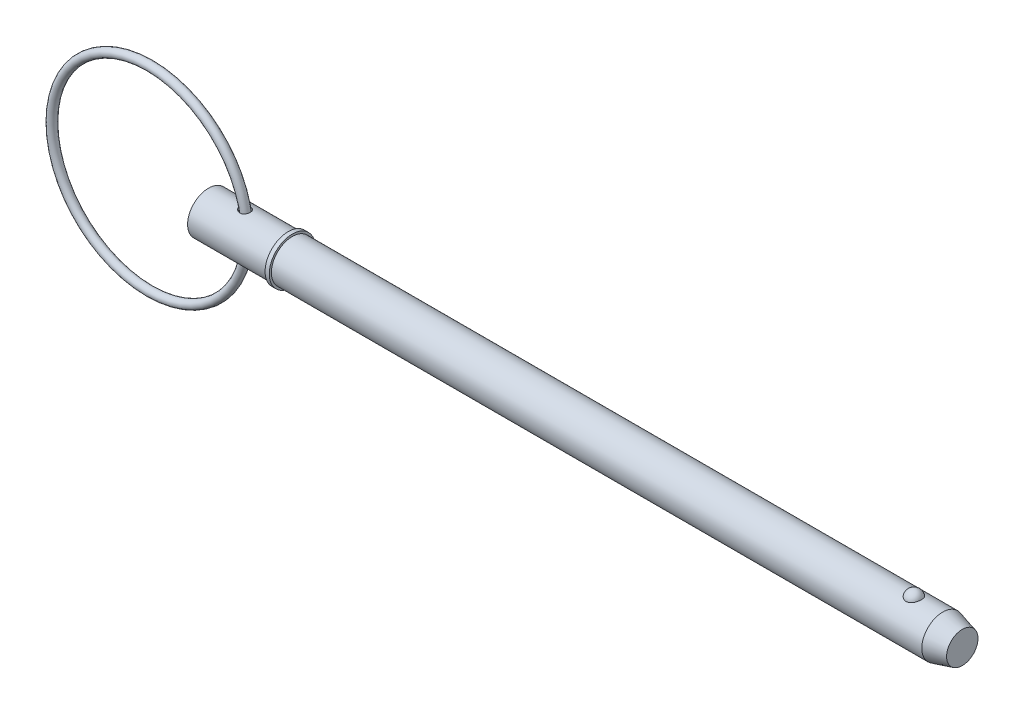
ISO-10303-21;
HEADER;
FILE_DESCRIPTION(('STEP AP214'),'2;1');
FILE_NAME('part.step','',(''),(''),'','','');
FILE_SCHEMA(('AUTOMOTIVE_DESIGN { 1 0 10303 214 1 1 1 1 }'));
ENDSEC;
DATA;
#1=APPLICATION_CONTEXT('core data for automotive mechanical design processes');
#2=APPLICATION_PROTOCOL_DEFINITION('international standard','automotive_design',2000,#1);
#3=PRODUCT_CONTEXT('',#1,'mechanical');
#4=PRODUCT('Part','Part','',(#3));
#5=PRODUCT_RELATED_PRODUCT_CATEGORY('part','',(#4));
#6=PRODUCT_DEFINITION_FORMATION('','',#4);
#7=PRODUCT_DEFINITION_CONTEXT('part definition',#1,'design');
#8=PRODUCT_DEFINITION('design','',#6,#7);
#9=PRODUCT_DEFINITION_SHAPE('','',#8);
#10=(LENGTH_UNIT() NAMED_UNIT(*) SI_UNIT(.MILLI.,.METRE.));
#11=(NAMED_UNIT(*) PLANE_ANGLE_UNIT() SI_UNIT($,.RADIAN.));
#12=(NAMED_UNIT(*) SI_UNIT($,.STERADIAN.) SOLID_ANGLE_UNIT());
#13=UNCERTAINTY_MEASURE_WITH_UNIT(LENGTH_MEASURE(1.E-05),#10,'distance_accuracy_value','');
#14=(GEOMETRIC_REPRESENTATION_CONTEXT(3) GLOBAL_UNCERTAINTY_ASSIGNED_CONTEXT((#13)) GLOBAL_UNIT_ASSIGNED_CONTEXT((#10,
#11,#12)) REPRESENTATION_CONTEXT('',''));
#15=CARTESIAN_POINT('',(0.,0.,0.));
#16=DIRECTION('',(0.,0.,1.));
#17=DIRECTION('',(1.,0.,0.));
#18=AXIS2_PLACEMENT_3D('',#15,#16,#17);
#19=CARTESIAN_POINT('',(-13.4013067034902,0.,0.));
#20=DIRECTION('',(0.,0.,1.));
#21=DIRECTION('',(1.,0.,0.));
#22=AXIS2_PLACEMENT_3D('',#19,#20,#21);
#23=TOROIDAL_SURFACE('',#22,22.225,0.952999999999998);
#24=CARTESIAN_POINT('',(9.77669329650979,0.,0.));
#25=VERTEX_POINT('',#24);
#26=VERTEX_LOOP('',#25);
#27=FACE_BOUND('',#26,.T.);
#28=ADVANCED_FACE('P0_F12',(#27),#23,.T.);
#29=CLOSED_SHELL('',(#28));
#30=MANIFOLD_SOLID_BREP('P0_B1',#29);
#31=CARTESIAN_POINT('',(0.,0.,0.));
#32=DIRECTION('',(1.,0.,0.));
#33=DIRECTION('',(0.,0.,-1.));
#34=AXIS2_PLACEMENT_3D('',#31,#32,#33);
#35=CYLINDRICAL_SURFACE('',#34,4.765);
#36=CARTESIAN_POINT('',(7.48459594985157,4.685973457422,-0.864220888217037));
#37=CARTESIAN_POINT('',(7.53849733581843,4.67711144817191,-0.912273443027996));
#38=CARTESIAN_POINT('',(7.59654891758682,4.66833039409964,-0.955745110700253));
#39=CARTESIAN_POINT('',(7.71924602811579,4.65195567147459,-1.03251233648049));
#40=CARTESIAN_POINT('',(7.78389917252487,4.64436340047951,-1.06579596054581));
#41=CARTESIAN_POINT('',(7.91808098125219,4.63129108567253,-1.12124172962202));
#42=CARTESIAN_POINT('',(7.98761280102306,4.62581242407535,-1.14339659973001));
#43=CARTESIAN_POINT('',(8.12956198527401,4.61771699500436,-1.17566870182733));
#44=CARTESIAN_POINT('',(8.20197774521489,4.61509865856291,-1.18579253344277));
#45=CARTESIAN_POINT('',(8.34550810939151,4.6131791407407,-1.19323853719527));
#46=CARTESIAN_POINT('',(8.41660306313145,4.61378793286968,-1.19090812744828));
#47=CARTESIAN_POINT('',(8.55721866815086,4.61812874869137,-1.17396277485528));
#48=CARTESIAN_POINT('',(8.62673979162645,4.62185982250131,-1.15935156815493));
#49=CARTESIAN_POINT('',(8.75801373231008,4.63172632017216,-1.11925454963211));
#50=CARTESIAN_POINT('',(8.81998342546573,4.63771186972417,-1.09443918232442));
#51=CARTESIAN_POINT('',(8.93863698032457,4.65140179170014,-1.03470792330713));
#52=CARTESIAN_POINT('',(8.99532131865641,4.65910600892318,-0.999792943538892));
#53=CARTESIAN_POINT('',(9.10080884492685,4.67519705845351,-0.921583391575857));
#54=CARTESIAN_POINT('',(9.14973848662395,4.68356861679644,-0.878455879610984));
#55=CARTESIAN_POINT('',(9.23971126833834,4.70019813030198,-0.784620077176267));
#56=CARTESIAN_POINT('',(9.28075401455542,4.7084560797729,-0.733911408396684));
#57=CARTESIAN_POINT('',(9.35441071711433,4.7240688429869,-0.62563775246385));
#58=CARTESIAN_POINT('',(9.38691359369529,4.73141115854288,-0.567995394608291));
#59=CARTESIAN_POINT('',(9.44203216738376,4.74427907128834,-0.447974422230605));
#60=CARTESIAN_POINT('',(9.46464743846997,4.74980459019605,-0.385595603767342));
#61=CARTESIAN_POINT('',(9.49961110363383,4.75848927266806,-0.257248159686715));
#62=CARTESIAN_POINT('',(9.51186382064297,4.76162635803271,-0.191251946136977));
#63=CARTESIAN_POINT('',(9.52545294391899,4.76511165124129,-0.0580729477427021));
#64=CARTESIAN_POINT('',(9.52678936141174,4.76545986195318,0.00910983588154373));
#65=CARTESIAN_POINT('',(9.51851557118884,4.76333054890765,0.142723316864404));
#66=CARTESIAN_POINT('',(9.50891008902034,4.76085424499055,0.209154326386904));
#67=CARTESIAN_POINT('',(9.47899306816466,4.75334441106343,0.339411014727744));
#68=CARTESIAN_POINT('',(9.45868126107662,4.74831081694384,0.403236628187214));
#69=CARTESIAN_POINT('',(9.4078294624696,4.73622777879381,0.526509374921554));
#70=CARTESIAN_POINT('',(9.37728413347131,4.72917728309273,0.585954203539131));
#71=CARTESIAN_POINT('',(9.30671117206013,4.71383320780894,0.698745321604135));
#72=CARTESIAN_POINT('',(9.26668347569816,4.70553961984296,0.752091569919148));
#73=CARTESIAN_POINT('',(9.17821531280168,4.68864637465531,0.851083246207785));
#74=CARTESIAN_POINT('',(9.12978756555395,4.68004719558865,0.896740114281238));
#75=CARTESIAN_POINT('',(9.02575872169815,4.66350833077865,0.97912505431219));
#76=CARTESIAN_POINT('',(8.97015856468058,4.65556855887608,1.01585429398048));
#77=CARTESIAN_POINT('',(8.85409306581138,4.6413534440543,1.0789347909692));
#78=CARTESIAN_POINT('',(8.79369898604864,4.63505812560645,1.10541268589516));
#79=CARTESIAN_POINT('',(8.66918290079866,4.62469916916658,1.1479836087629));
#80=CARTESIAN_POINT('',(8.60506121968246,4.62063533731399,1.1640775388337));
#81=CARTESIAN_POINT('',(8.47537782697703,4.61517348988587,1.18554696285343));
#82=CARTESIAN_POINT('',(8.4098281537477,4.61375835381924,1.19099130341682));
#83=CARTESIAN_POINT('',(8.2786938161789,4.61362908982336,1.19149080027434));
#84=CARTESIAN_POINT('',(8.21310914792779,4.61491539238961,1.18654430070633));
#85=CARTESIAN_POINT('',(8.08152457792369,4.62006017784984,1.16635311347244));
#86=CARTESIAN_POINT('',(8.01557748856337,4.62399895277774,1.15078675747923));
#87=CARTESIAN_POINT('',(7.88704537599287,4.63403793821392,1.10966738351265));
#88=CARTESIAN_POINT('',(7.82446148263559,4.64013886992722,1.08411103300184));
#89=CARTESIAN_POINT('',(7.70057947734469,4.65423592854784,1.02195168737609));
#90=CARTESIAN_POINT('',(7.63957197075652,4.66232221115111,0.984788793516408));
#91=CARTESIAN_POINT('',(7.52457021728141,4.67924552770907,0.900950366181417));
#92=CARTESIAN_POINT('',(7.47057819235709,4.68808279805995,0.854271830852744));
#93=CARTESIAN_POINT('',(7.37028930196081,4.70567913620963,0.751386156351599));
#94=CARTESIAN_POINT('',(7.32416327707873,4.7144333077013,0.695010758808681));
#95=CARTESIAN_POINT('',(7.24276674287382,4.73060166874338,0.574719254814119));
#96=CARTESIAN_POINT('',(7.20749051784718,4.73801656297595,0.510807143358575));
#97=CARTESIAN_POINT('',(7.15148495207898,4.75009927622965,0.381705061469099));
#98=CARTESIAN_POINT('',(7.12994463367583,4.7549169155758,0.31688231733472));
#99=CARTESIAN_POINT('',(7.09904467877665,4.76189692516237,0.184270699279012));
#100=CARTESIAN_POINT('',(7.08967554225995,4.76406136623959,0.116484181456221));
#101=CARTESIAN_POINT('',(7.08394150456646,4.76538257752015,-0.0133529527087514));
#102=CARTESIAN_POINT('',(7.0864533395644,4.76479916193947,-0.0753538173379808));
#103=CARTESIAN_POINT('',(7.10181380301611,4.76127985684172,-0.197993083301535));
#104=CARTESIAN_POINT('',(7.11466291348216,4.75834385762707,-0.258631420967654));
#105=CARTESIAN_POINT('',(7.14973937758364,4.75051877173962,-0.375744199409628));
#106=CARTESIAN_POINT('',(7.17178938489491,4.7456667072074,-0.432274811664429));
#107=CARTESIAN_POINT('',(7.22432962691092,4.73449674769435,-0.54107038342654));
#108=CARTESIAN_POINT('',(7.25481702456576,4.72817934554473,-0.593336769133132));
#109=CARTESIAN_POINT('',(7.31700895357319,4.71588241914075,-0.683642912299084));
#110=CARTESIAN_POINT('',(7.34750058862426,4.7100477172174,-0.722547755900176));
#111=CARTESIAN_POINT('',(7.41288050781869,4.69812059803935,-0.796421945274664));
#112=CARTESIAN_POINT('',(7.44776960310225,4.69202813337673,-0.831390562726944));
#113=CARTESIAN_POINT('',(7.48459594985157,4.685973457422,-0.864220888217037));
#114=B_SPLINE_CURVE_WITH_KNOTS('',3,(#36,#37,#38,#39,#40,#41,#42,#43,#44,#45,#46,#47,#48,#49,
#50,#51,#52,#53,#54,#55,#56,#57,#58,#59,#60,#61,#62,#63,#64,#65,#66,#67,#68,#69,#70,#71,#72,#73,
#74,#75,#76,#77,#78,#79,#80,#81,#82,#83,#84,#85,#86,#87,#88,#89,#90,#91,#92,#93,#94,#95,#96,#97,
#98,#99,#100,#101,#102,#103,#104,#105,#106,#107,#108,#109,#110,#111,#112,#113),.UNSPECIFIED.,
.T.,.F.,(4,2,2,2,2,2,2,2,2,2,2,2,2,2,2,2,2,2,2,2,2,2,2,2,2,2,2,2,2,2,2,2,2,2,2,2,2,2,4),(0.,
0.218078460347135,0.436411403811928,0.654886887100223,0.873242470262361,1.08553925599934,
1.2977714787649,1.49785367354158,1.6979178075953,1.8942789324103,2.09064985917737,
2.28946102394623,2.48828075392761,2.68891673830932,2.88955251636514,3.09010167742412,
3.29065586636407,3.49131482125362,3.69197512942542,3.89233421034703,4.09266707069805,
4.29043955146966,4.48819484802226,4.68466743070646,4.8811713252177,5.08390806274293,
5.28671248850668,5.50140943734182,5.71617422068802,5.93513249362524,6.15397522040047,
6.35827356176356,6.56241234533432,6.74765856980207,6.93291343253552,7.11475139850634,
7.29652829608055,7.44549570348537,7.59449062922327),.UNSPECIFIED.);
#115=CARTESIAN_POINT('',(7.48459594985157,4.685973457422,-0.864220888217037));
#116=VERTEX_POINT('',#115);
#117=EDGE_CURVE('P1_E42',#116,#116,#114,.T.);
#118=ORIENTED_EDGE('',*,*,#117,.T.);
#119=EDGE_LOOP('',(#118));
#120=FACE_BOUND('',#119,.T.);
#121=CARTESIAN_POINT('',(0.,0.,0.));
#122=DIRECTION('',(1.,0.,0.));
#123=DIRECTION('',(0.,0.,-1.));
#124=AXIS2_PLACEMENT_3D('',#121,#122,#123);
#125=CIRCLE('',#124,4.765);
#126=CARTESIAN_POINT('',(0.,0.,-4.765));
#127=VERTEX_POINT('',#126);
#128=EDGE_CURVE('P1_E9',#127,#127,#125,.T.);
#129=ORIENTED_EDGE('',*,*,#128,.T.);
#130=EDGE_LOOP('',(#129));
#131=FACE_BOUND('',#130,.T.);
#132=CARTESIAN_POINT('',(18.097,0.,0.));
#133=DIRECTION('',(1.,0.,0.));
#134=DIRECTION('',(0.,0.,-1.));
#135=AXIS2_PLACEMENT_3D('',#132,#133,#134);
#136=CIRCLE('',#135,4.765);
#137=CARTESIAN_POINT('',(18.097,0.,-4.765));
#138=VERTEX_POINT('',#137);
#139=EDGE_CURVE('P1_E25',#138,#138,#136,.T.);
#140=ORIENTED_EDGE('',*,*,#139,.F.);
#141=EDGE_LOOP('',(#140));
#142=FACE_BOUND('',#141,.T.);
#143=CARTESIAN_POINT('',(7.48459594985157,-4.685973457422,-0.864220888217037));
#144=CARTESIAN_POINT('',(7.43440944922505,-4.6942250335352,-0.819477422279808));
#145=CARTESIAN_POINT('',(7.38778663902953,-4.70255210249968,-0.77073361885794));
#146=CARTESIAN_POINT('',(7.3030968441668,-4.7184989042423,-0.666172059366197));
#147=CARTESIAN_POINT('',(7.26503010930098,-4.72611861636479,-0.610354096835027));
#148=CARTESIAN_POINT('',(7.19878266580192,-4.73983819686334,-0.492624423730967));
#149=CARTESIAN_POINT('',(7.17064194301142,-4.74593188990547,-0.430689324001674));
#150=CARTESIAN_POINT('',(7.12584349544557,-4.75581281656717,-0.3026233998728));
#151=CARTESIAN_POINT('',(7.10917889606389,-4.75960143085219,-0.236495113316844));
#152=CARTESIAN_POINT('',(7.0889853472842,-4.76421379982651,-0.106818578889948));
#153=CARTESIAN_POINT('',(7.0846333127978,-4.76522320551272,-0.0434047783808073));
#154=CARTESIAN_POINT('',(7.08693064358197,-4.7646936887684,0.0832041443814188));
#155=CARTESIAN_POINT('',(7.09357756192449,-4.76315533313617,0.146399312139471));
#156=CARTESIAN_POINT('',(7.11694629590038,-4.75784365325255,0.267709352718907));
#157=CARTESIAN_POINT('',(7.13318365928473,-4.75417793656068,0.325923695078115));
#158=CARTESIAN_POINT('',(7.17459606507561,-4.74508048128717,0.438922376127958));
#159=CARTESIAN_POINT('',(7.19977257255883,-4.73964845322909,0.493706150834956));
#160=CARTESIAN_POINT('',(7.25946789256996,-4.72725615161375,0.60111049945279));
#161=CARTESIAN_POINT('',(7.2943661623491,-4.72023663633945,0.653512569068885));
#162=CARTESIAN_POINT('',(7.37173226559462,-4.70550732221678,0.752279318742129));
#163=CARTESIAN_POINT('',(7.41420315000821,-4.69779724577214,0.798641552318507));
#164=CARTESIAN_POINT('',(7.50982312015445,-4.6816641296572,0.888551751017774));
#165=CARTESIAN_POINT('',(7.56359853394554,-4.67324162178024,0.931434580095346));
#166=CARTESIAN_POINT('',(7.67736628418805,-4.65728554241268,1.00819498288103));
#167=CARTESIAN_POINT('',(7.7373611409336,-4.64975233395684,1.04206888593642));
#168=CARTESIAN_POINT('',(7.86574076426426,-4.63599923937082,1.10169445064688));
#169=CARTESIAN_POINT('',(7.93441048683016,-4.62988111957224,1.12685968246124));
#170=CARTESIAN_POINT('',(8.07519000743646,-4.62035710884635,1.16529928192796));
#171=CARTESIAN_POINT('',(8.14729925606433,-4.61695078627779,1.1785755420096));
#172=CARTESIAN_POINT('',(8.29111621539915,-4.61341807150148,1.19232949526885));
#173=CARTESIAN_POINT('',(8.36279361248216,-4.61321655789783,1.19310032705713));
#174=CARTESIAN_POINT('',(8.50512944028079,-4.61602317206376,1.1821962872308));
#175=CARTESIAN_POINT('',(8.57578827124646,-4.61903000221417,1.17052644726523));
#176=CARTESIAN_POINT('',(8.70965757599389,-4.62766311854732,1.13589249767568));
#177=CARTESIAN_POINT('',(8.77306169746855,-4.63312492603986,1.11363308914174));
#178=CARTESIAN_POINT('',(8.8949702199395,-4.64598463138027,1.05869880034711));
#179=CARTESIAN_POINT('',(8.95347516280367,-4.65338231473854,1.02602507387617));
#180=CARTESIAN_POINT('',(9.06253415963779,-4.66906009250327,0.952097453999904));
#181=CARTESIAN_POINT('',(9.11324728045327,-4.67731427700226,0.911072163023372));
#182=CARTESIAN_POINT('',(9.20707850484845,-4.69393979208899,0.821122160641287));
#183=CARTESIAN_POINT('',(9.25019629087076,-4.70231112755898,0.772197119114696));
#184=CARTESIAN_POINT('',(9.32819072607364,-4.71835356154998,0.667239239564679));
#185=CARTESIAN_POINT('',(9.36297449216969,-4.72601623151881,0.611136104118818));
#186=CARTESIAN_POINT('',(9.42286382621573,-4.73971239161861,0.493799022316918));
#187=CARTESIAN_POINT('',(9.44796891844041,-4.74574580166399,0.432564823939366));
#188=CARTESIAN_POINT('',(9.48811605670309,-4.75559286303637,0.305990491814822));
#189=CARTESIAN_POINT('',(9.50304870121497,-4.75938232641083,0.240613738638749));
#190=CARTESIAN_POINT('',(9.5220569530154,-4.76423188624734,0.108201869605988));
#191=CARTESIAN_POINT('',(9.52613255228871,-4.76529198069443,0.0411667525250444));
#192=CARTESIAN_POINT('',(9.52332772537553,-4.76456884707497,-0.0926701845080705));
#193=CARTESIAN_POINT('',(9.51644541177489,-4.76278512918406,-0.159471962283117));
#194=CARTESIAN_POINT('',(9.49188827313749,-4.75656536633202,-0.290934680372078));
#195=CARTESIAN_POINT('',(9.47421322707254,-4.75212926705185,-0.355595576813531));
#196=CARTESIAN_POINT('',(9.42849503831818,-4.74108318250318,-0.480955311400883));
#197=CARTESIAN_POINT('',(9.4004503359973,-4.73447287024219,-0.541653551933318));
#198=CARTESIAN_POINT('',(9.33467290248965,-4.71979928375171,-0.657361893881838));
#199=CARTESIAN_POINT('',(9.29694000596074,-4.71173598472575,-0.712371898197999));
#200=CARTESIAN_POINT('',(9.2127449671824,-4.69505469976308,-0.815106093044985));
#201=CARTESIAN_POINT('',(9.1662875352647,-4.68643701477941,-0.862834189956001));
#202=CARTESIAN_POINT('',(9.06584125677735,-4.66961864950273,-0.949656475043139));
#203=CARTESIAN_POINT('',(9.01185326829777,-4.66141792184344,-0.98875164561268));
#204=CARTESIAN_POINT('',(8.8985010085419,-4.64646376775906,-1.0567894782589));
#205=CARTESIAN_POINT('',(8.83920621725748,-4.63969468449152,-1.08584444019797));
#206=CARTESIAN_POINT('',(8.71642097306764,-4.62824519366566,-1.13365785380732));
#207=CARTESIAN_POINT('',(8.65293102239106,-4.623564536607,-1.15241753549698));
#208=CARTESIAN_POINT('',(8.52421291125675,-4.61681938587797,-1.17914952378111));
#209=CARTESIAN_POINT('',(8.45900634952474,-4.6147310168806,-1.18722032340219));
#210=CARTESIAN_POINT('',(8.32811210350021,-4.61325848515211,-1.19292878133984));
#211=CARTESIAN_POINT('',(8.26242433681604,-4.61387479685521,-1.19056460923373));
#212=CARTESIAN_POINT('',(8.13057358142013,-4.6177227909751,-1.17555160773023));
#213=CARTESIAN_POINT('',(8.06444352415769,-4.62102282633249,-1.16263394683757));
#214=CARTESIAN_POINT('',(7.93513143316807,-4.62989870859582,-1.12676570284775));
#215=CARTESIAN_POINT('',(7.87194976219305,-4.6354748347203,-1.10381388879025));
#216=CARTESIAN_POINT('',(7.75155849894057,-4.64811746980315,-1.04928030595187));
#217=CARTESIAN_POINT('',(7.69423767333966,-4.65514232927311,-1.01793362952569));
#218=CARTESIAN_POINT('',(7.58503138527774,-4.67007903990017,-0.947046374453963));
#219=CARTESIAN_POINT('',(7.53314612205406,-4.67799092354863,-0.907505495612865));
#220=CARTESIAN_POINT('',(7.48459594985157,-4.685973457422,-0.864220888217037));
#221=B_SPLINE_CURVE_WITH_KNOTS('',3,(#143,#144,#145,#146,#147,#148,#149,#150,#151,#152,#153,
#154,#155,#156,#157,#158,#159,#160,#161,#162,#163,#164,#165,#166,#167,#168,#169,#170,#171,#172,
#173,#174,#175,#176,#177,#178,#179,#180,#181,#182,#183,#184,#185,#186,#187,#188,#189,#190,#191,
#192,#193,#194,#195,#196,#197,#198,#199,#200,#201,#202,#203,#204,#205,#206,#207,#208,#209,#210,
#211,#212,#213,#214,#215,#216,#217,#218,#219,#220),.UNSPECIFIED.,.T.,.F.,(4,2,2,2,2,2,2,2,2,2,2,
2,2,2,2,2,2,2,2,2,2,2,2,2,2,2,2,2,2,2,2,2,2,2,2,2,2,2,4),(0.,0.203013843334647,
0.406033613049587,0.609862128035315,0.813568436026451,1.0032929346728,1.19297523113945,
1.37380897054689,1.55467236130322,1.74393241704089,1.93326889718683,2.14025373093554,
2.3473227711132,2.566425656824,2.78549366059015,2.9994188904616,3.21325763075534,
3.41451842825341,3.61575693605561,3.81208930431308,4.00842987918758,4.20686629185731,
4.40531245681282,4.60586051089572,4.80640871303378,5.0069914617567,5.20757831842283,
5.40819535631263,5.60881581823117,5.80932827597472,6.00981790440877,6.2079863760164,
6.40613116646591,6.60243714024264,6.79877754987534,7.00028133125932,7.20180983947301,
7.39819723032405,7.59459181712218),.UNSPECIFIED.);
#222=CARTESIAN_POINT('',(7.48459594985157,-4.685973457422,-0.864220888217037));
#223=VERTEX_POINT('',#222);
#224=EDGE_CURVE('P1_E17',#223,#223,#221,.T.);
#225=ORIENTED_EDGE('',*,*,#224,.T.);
#226=EDGE_LOOP('',(#225));
#227=FACE_BOUND('',#226,.T.);
#228=ADVANCED_FACE('P1_F13',(#120,#131,#142,#227),#35,.T.);
#229=CARTESIAN_POINT('',(0.,0.,0.));
#230=DIRECTION('',(1.,0.,0.));
#231=DIRECTION('',(0.,0.,-1.));
#232=AXIS2_PLACEMENT_3D('',#229,#230,#231);
#233=CYLINDRICAL_SURFACE('',#232,4.765);
#234=CARTESIAN_POINT('',(167.004194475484,0.,0.));
#235=DIRECTION('',(1.,0.,0.));
#236=DIRECTION('',(0.,0.,-1.));
#237=AXIS2_PLACEMENT_3D('',#234,#235,#236);
#238=CIRCLE('',#237,4.765);
#239=CARTESIAN_POINT('',(167.004194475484,0.,-4.765));
#240=VERTEX_POINT('',#239);
#241=EDGE_CURVE('P1_E99',#240,#240,#238,.T.);
#242=ORIENTED_EDGE('',*,*,#241,.F.);
#243=EDGE_LOOP('',(#242));
#244=FACE_BOUND('',#243,.T.);
#245=CARTESIAN_POINT('',(19.05,0.,0.));
#246=DIRECTION('',(1.,0.,0.));
#247=DIRECTION('',(0.,0.,-1.));
#248=AXIS2_PLACEMENT_3D('',#245,#246,#247);
#249=CIRCLE('',#248,4.765);
#250=CARTESIAN_POINT('',(19.05,0.,-4.765));
#251=VERTEX_POINT('',#250);
#252=EDGE_CURVE('P1_E96',#251,#251,#249,.T.);
#253=ORIENTED_EDGE('',*,*,#252,.T.);
#254=EDGE_LOOP('',(#253));
#255=FACE_BOUND('',#254,.T.);
#256=CARTESIAN_POINT('',(160.451020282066,4.42764777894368,1.76101111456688));
#257=CARTESIAN_POINT('',(160.359721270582,4.42764470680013,1.76101422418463));
#258=CARTESIAN_POINT('',(160.268446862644,4.43059091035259,1.75366340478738));
#259=CARTESIAN_POINT('',(160.088615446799,4.44201846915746,1.72451180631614));
#260=CARTESIAN_POINT('',(160.000057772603,4.45049845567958,1.70271460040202));
#261=CARTESIAN_POINT('',(159.828257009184,4.47200516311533,1.64539370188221));
#262=CARTESIAN_POINT('',(159.745006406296,4.48502527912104,1.60988994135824));
#263=CARTESIAN_POINT('',(159.585763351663,4.51419542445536,1.52617873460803));
#264=CARTESIAN_POINT('',(159.509772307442,4.53034605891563,1.47796883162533));
#265=CARTESIAN_POINT('',(159.364744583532,4.56459317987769,1.36860494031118));
#266=CARTESIAN_POINT('',(159.295964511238,4.58273170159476,1.30712420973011));
#267=CARTESIAN_POINT('',(159.169342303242,4.61870302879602,1.17370204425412));
#268=CARTESIAN_POINT('',(159.111502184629,4.63653577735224,1.10175868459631));
#269=CARTESIAN_POINT('',(159.005570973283,4.67090140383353,0.945806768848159));
#270=CARTESIAN_POINT('',(158.958030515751,4.68734068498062,0.861402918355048));
#271=CARTESIAN_POINT('',(158.877081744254,4.71628466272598,0.685442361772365));
#272=CARTESIAN_POINT('',(158.843674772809,4.72878898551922,0.593884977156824));
#273=CARTESIAN_POINT('',(158.791287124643,4.74874061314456,0.404781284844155));
#274=CARTESIAN_POINT('',(158.772517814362,4.75611366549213,0.307168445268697));
#275=CARTESIAN_POINT('',(158.750584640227,4.76475393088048,0.109940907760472));
#276=CARTESIAN_POINT('',(158.747420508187,4.76602124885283,0.0103262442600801));
#277=CARTESIAN_POINT('',(158.756740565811,4.76232928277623,-0.187629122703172));
#278=CARTESIAN_POINT('',(158.769158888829,4.7573962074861,-0.285973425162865));
#279=CARTESIAN_POINT('',(158.809280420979,4.74184975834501,-0.479027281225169));
#280=CARTESIAN_POINT('',(158.836983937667,4.7312362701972,-0.573736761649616));
#281=CARTESIAN_POINT('',(158.907158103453,4.70540026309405,-0.756973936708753));
#282=CARTESIAN_POINT('',(158.949646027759,4.69017235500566,-0.84549425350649));
#283=CARTESIAN_POINT('',(159.048520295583,4.6566986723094,-1.01378033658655));
#284=CARTESIAN_POINT('',(159.104907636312,4.63845268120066,-1.09354547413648));
#285=CARTESIAN_POINT('',(159.230552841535,4.60085438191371,-1.24228523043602));
#286=CARTESIAN_POINT('',(159.299843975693,4.58149930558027,-1.31123108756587));
#287=CARTESIAN_POINT('',(159.449606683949,4.54391653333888,-1.43607409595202));
#288=CARTESIAN_POINT('',(159.530077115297,4.52568872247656,-1.49197257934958));
#289=CARTESIAN_POINT('',(159.698150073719,4.49293007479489,-1.58786764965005));
#290=CARTESIAN_POINT('',(159.785544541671,4.47832346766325,-1.62820219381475));
#291=CARTESIAN_POINT('',(159.966553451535,4.45406011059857,-1.69345757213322));
#292=CARTESIAN_POINT('',(160.06016555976,4.44440151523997,-1.71838415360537));
#293=CARTESIAN_POINT('',(160.245893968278,4.43159888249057,-1.75112843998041));
#294=CARTESIAN_POINT('',(160.337849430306,4.42815213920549,-1.75974223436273));
#295=CARTESIAN_POINT('',(160.521965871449,4.427247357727,-1.76201865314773));
#296=CARTESIAN_POINT('',(160.614126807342,4.42978816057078,-1.7556841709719));
#297=CARTESIAN_POINT('',(160.793129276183,4.44038648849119,-1.72869560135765));
#298=CARTESIAN_POINT('',(160.880047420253,4.44827555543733,-1.70847853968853));
#299=CARTESIAN_POINT('',(161.049131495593,4.46852246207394,-1.65479562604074));
#300=CARTESIAN_POINT('',(161.131297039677,4.48088066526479,-1.62132869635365));
#301=CARTESIAN_POINT('',(161.290591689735,4.50907357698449,-1.54120560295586));
#302=CARTESIAN_POINT('',(161.367570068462,4.52497884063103,-1.49427526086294));
#303=CARTESIAN_POINT('',(161.512708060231,4.55845148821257,-1.38881222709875));
#304=CARTESIAN_POINT('',(161.580865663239,4.57601924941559,-1.33027689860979));
#305=CARTESIAN_POINT('',(161.710099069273,4.61196537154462,-1.19991049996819));
#306=CARTESIAN_POINT('',(161.770656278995,4.63034074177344,-1.12756415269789));
#307=CARTESIAN_POINT('',(161.879279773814,4.66513959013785,-0.973612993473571));
#308=CARTESIAN_POINT('',(161.927343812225,4.68156271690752,-0.892006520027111));
#309=CARTESIAN_POINT('',(162.011383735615,4.71130224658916,-0.718892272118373));
#310=CARTESIAN_POINT('',(162.046918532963,4.724501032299,-0.627149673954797));
#311=CARTESIAN_POINT('',(162.102952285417,4.74571823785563,-0.438611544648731));
#312=CARTESIAN_POINT('',(162.123450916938,4.75373654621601,-0.341815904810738));
#313=CARTESIAN_POINT('',(162.149033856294,4.76378905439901,-0.145633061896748));
#314=CARTESIAN_POINT('',(162.154076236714,4.76580697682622,-0.0462395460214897));
#315=CARTESIAN_POINT('',(162.148523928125,4.7636057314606,0.152038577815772));
#316=CARTESIAN_POINT('',(162.137929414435,4.75938663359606,0.250923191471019));
#317=CARTESIAN_POINT('',(162.101387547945,4.74516937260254,0.445004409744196));
#318=CARTESIAN_POINT('',(162.075496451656,4.73519238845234,0.540213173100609));
#319=CARTESIAN_POINT('',(162.008927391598,4.71049394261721,0.724662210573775));
#320=CARTESIAN_POINT('',(161.968248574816,4.69577220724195,0.813902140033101));
#321=CARTESIAN_POINT('',(161.872717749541,4.66303767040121,0.98431305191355));
#322=CARTESIAN_POINT('',(161.817804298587,4.64501070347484,1.06544688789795));
#323=CARTESIAN_POINT('',(161.695049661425,4.60764678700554,1.21692673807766));
#324=CARTESIAN_POINT('',(161.627208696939,4.58830985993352,1.28727293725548));
#325=CARTESIAN_POINT('',(161.480548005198,4.55060370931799,1.41479271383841));
#326=CARTESIAN_POINT('',(161.401791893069,4.53222967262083,1.47203785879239));
#327=CARTESIAN_POINT('',(161.234989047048,4.49849576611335,1.57212016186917));
#328=CARTESIAN_POINT('',(161.146941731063,4.48313608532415,1.6149564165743));
#329=CARTESIAN_POINT('',(160.959791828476,4.45676184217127,1.68642657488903));
#330=CARTESIAN_POINT('',(160.860365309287,4.44598302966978,1.71430590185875));
#331=CARTESIAN_POINT('',(160.657621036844,4.43142918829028,1.75159258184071));
#332=CARTESIAN_POINT('',(160.554304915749,4.42765125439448,1.76100759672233));
#333=CARTESIAN_POINT('',(160.451020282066,4.42764777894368,1.76101111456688));
#334=B_SPLINE_CURVE_WITH_KNOTS('',3,(#256,#257,#258,#259,#260,#261,#262,#263,#264,#265,#266,
#267,#268,#269,#270,#271,#272,#273,#274,#275,#276,#277,#278,#279,#280,#281,#282,#283,#284,#285,
#286,#287,#288,#289,#290,#291,#292,#293,#294,#295,#296,#297,#298,#299,#300,#301,#302,#303,#304,
#305,#306,#307,#308,#309,#310,#311,#312,#313,#314,#315,#316,#317,#318,#319,#320,#321,#322,#323,
#324,#325,#326,#327,#328,#329,#330,#331,#332,#333),.UNSPECIFIED.,.T.,.F.,(4,2,2,2,2,2,2,2,2,2,2,
2,2,2,2,2,2,2,2,2,2,2,2,2,2,2,2,2,2,2,2,2,2,2,2,2,2,2,4),(0.,0.273517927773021,
0.546968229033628,0.820022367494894,1.09312934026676,1.37393946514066,1.6548013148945,
1.94820420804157,2.24163496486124,2.53922817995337,2.83681628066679,3.13315071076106,
3.42949110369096,3.72617893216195,4.02288805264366,4.32037303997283,4.61782764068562,
4.90840095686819,5.19886582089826,5.47474855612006,5.75057789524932,6.0180997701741,
6.28564340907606,6.55907787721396,6.83257454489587,7.11962987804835,7.40673679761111,
7.70312663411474,7.99952284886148,8.29672237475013,8.59391856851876,8.89002850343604,
9.18615552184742,9.48358266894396,9.78100471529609,10.0767610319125,10.3725358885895,
10.6820893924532,10.991514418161),.UNSPECIFIED.);
#335=CARTESIAN_POINT('',(160.451020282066,4.42764777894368,1.76101111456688));
#336=VERTEX_POINT('',#335);
#337=EDGE_CURVE('P1_E34',#336,#336,#334,.T.);
#338=ORIENTED_EDGE('',*,*,#337,.T.);
#339=EDGE_LOOP('',(#338));
#340=FACE_BOUND('',#339,.T.);
#341=ADVANCED_FACE('P1_F46',(#244,#255,#340),#233,.T.);
#342=CARTESIAN_POINT('',(0.,0.,0.));
#343=DIRECTION('',(-1.,0.,0.));
#344=DIRECTION('',(0.,0.,1.));
#345=AXIS2_PLACEMENT_3D('',#342,#343,#344);
#346=PLANE('',#345);
#347=ORIENTED_EDGE('',*,*,#128,.F.);
#348=EDGE_LOOP('',(#347));
#349=FACE_BOUND('',#348,.T.);
#350=ADVANCED_FACE('P1_F15',(#349),#346,.T.);
#351=CARTESIAN_POINT('',(18.097,4.765,0.));
#352=DIRECTION('',(-1.,0.,0.));
#353=DIRECTION('',(0.,0.,1.));
#354=AXIS2_PLACEMENT_3D('',#351,#352,#353);
#355=PLANE('',#354);
#356=ORIENTED_EDGE('',*,*,#139,.T.);
#357=EDGE_LOOP('',(#356));
#358=FACE_BOUND('',#357,.T.);
#359=CARTESIAN_POINT('',(18.097,0.,0.));
#360=DIRECTION('',(1.,0.,0.));
#361=DIRECTION('',(0.,0.,-1.));
#362=AXIS2_PLACEMENT_3D('',#359,#360,#361);
#363=CIRCLE('',#362,5.2415);
#364=CARTESIAN_POINT('',(18.097,0.,-5.2415));
#365=VERTEX_POINT('',#364);
#366=EDGE_CURVE('P1_E30',#365,#365,#363,.T.);
#367=ORIENTED_EDGE('',*,*,#366,.F.);
#368=EDGE_LOOP('',(#367));
#369=FACE_BOUND('',#368,.T.);
#370=ADVANCED_FACE('P1_F81',(#358,#369),#355,.T.);
#371=CARTESIAN_POINT('',(0.,0.,0.));
#372=DIRECTION('',(1.,0.,0.));
#373=DIRECTION('',(0.,0.,-1.));
#374=AXIS2_PLACEMENT_3D('',#371,#372,#373);
#375=CYLINDRICAL_SURFACE('',#374,5.2415);
#376=ORIENTED_EDGE('',*,*,#366,.T.);
#377=EDGE_LOOP('',(#376));
#378=FACE_BOUND('',#377,.T.);
#379=CARTESIAN_POINT('',(19.05,0.,0.));
#380=DIRECTION('',(1.,0.,0.));
#381=DIRECTION('',(0.,0.,-1.));
#382=AXIS2_PLACEMENT_3D('',#379,#380,#381);
#383=CIRCLE('',#382,5.2415);
#384=CARTESIAN_POINT('',(19.05,0.,-5.2415));
#385=VERTEX_POINT('',#384);
#386=EDGE_CURVE('P1_E95',#385,#385,#383,.T.);
#387=ORIENTED_EDGE('',*,*,#386,.F.);
#388=EDGE_LOOP('',(#387));
#389=FACE_BOUND('',#388,.T.);
#390=ADVANCED_FACE('P1_F68',(#378,#389),#375,.T.);
#391=CARTESIAN_POINT('',(19.05,5.2415,0.));
#392=DIRECTION('',(1.,0.,0.));
#393=DIRECTION('',(0.,0.,-1.));
#394=AXIS2_PLACEMENT_3D('',#391,#392,#393);
#395=PLANE('',#394);
#396=ORIENTED_EDGE('',*,*,#386,.T.);
#397=EDGE_LOOP('',(#396));
#398=FACE_BOUND('',#397,.T.);
#399=ORIENTED_EDGE('',*,*,#252,.F.);
#400=EDGE_LOOP('',(#399));
#401=FACE_BOUND('',#400,.T.);
#402=ADVANCED_FACE('P1_F62',(#398,#401),#395,.T.);
#403=CARTESIAN_POINT('',(171.45,0.,0.));
#404=DIRECTION('',(-1.,0.,0.));
#405=DIRECTION('',(0.,0.,1.));
#406=AXIS2_PLACEMENT_3D('',#403,#404,#405);
#407=CONICAL_SURFACE('',#406,3.57375000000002,0.261799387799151);
#408=ORIENTED_EDGE('',*,*,#241,.T.);
#409=EDGE_LOOP('',(#408));
#410=FACE_BOUND('',#409,.T.);
#411=CARTESIAN_POINT('',(171.45,0.,0.));
#412=DIRECTION('',(1.,0.,0.));
#413=DIRECTION('',(0.,0.,-1.));
#414=AXIS2_PLACEMENT_3D('',#411,#412,#413);
#415=CIRCLE('',#414,3.57375000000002);
#416=CARTESIAN_POINT('',(171.45,0.,-3.57375000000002));
#417=VERTEX_POINT('',#416);
#418=EDGE_CURVE('P1_E41',#417,#417,#415,.T.);
#419=ORIENTED_EDGE('',*,*,#418,.F.);
#420=EDGE_LOOP('',(#419));
#421=FACE_BOUND('',#420,.T.);
#422=ADVANCED_FACE('P1_F59',(#410,#421),#407,.T.);
#423=CARTESIAN_POINT('',(171.45,3.57375000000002,0.));
#424=DIRECTION('',(1.,0.,0.));
#425=DIRECTION('',(0.,0.,-1.));
#426=AXIS2_PLACEMENT_3D('',#423,#424,#425);
#427=PLANE('',#426);
#428=ORIENTED_EDGE('',*,*,#418,.T.);
#429=EDGE_LOOP('',(#428));
#430=FACE_BOUND('',#429,.T.);
#431=ADVANCED_FACE('P1_F55',(#430),#427,.T.);
#432=CARTESIAN_POINT('',(160.451020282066,4.28849999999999,0.));
#433=DIRECTION('',(-1.,0.,0.));
#434=DIRECTION('',(0.,1.,0.));
#435=AXIS2_PLACEMENT_3D('',#432,#433,#434);
#436=SPHERICAL_SURFACE('',#435,1.7665);
#437=ORIENTED_EDGE('',*,*,#337,.F.);
#438=EDGE_LOOP('',(#437));
#439=FACE_BOUND('',#438,.T.);
#440=ADVANCED_FACE('P1_F50',(#439),#436,.T.);
#441=CARTESIAN_POINT('',(-13.4013067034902,0.,0.));
#442=DIRECTION('',(0.,0.,1.));
#443=DIRECTION('',(1.,0.,0.));
#444=AXIS2_PLACEMENT_3D('',#441,#442,#443);
#445=TOROIDAL_SURFACE('',#444,22.225,1.19125);
#446=ORIENTED_EDGE('',*,*,#224,.F.);
#447=EDGE_LOOP('',(#446));
#448=FACE_BOUND('',#447,.T.);
#449=ORIENTED_EDGE('',*,*,#117,.F.);
#450=EDGE_LOOP('',(#449));
#451=FACE_BOUND('',#450,.T.);
#452=ADVANCED_FACE('P1_F54',(#448,#451),#445,.F.);
#453=CLOSED_SHELL('',(#228,#341,#350,#370,#390,#402,#422,#431,#440,#452));
#454=MANIFOLD_SOLID_BREP('P1_B1',#453);
#455=ADVANCED_BREP_SHAPE_REPRESENTATION('',(#18,#30,#454),#14);
#456=SHAPE_DEFINITION_REPRESENTATION(#9,#455);
ENDSEC;
END-ISO-10303-21;
